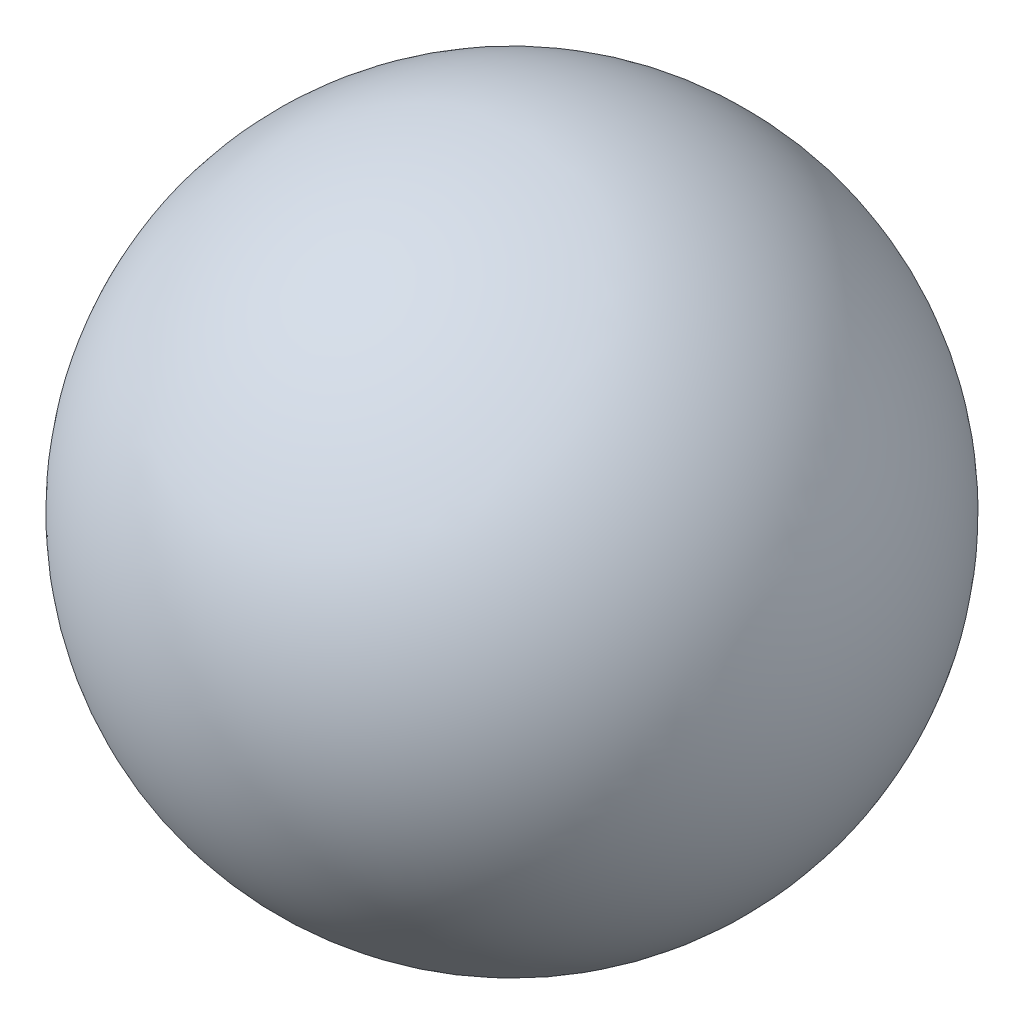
from build123d import *


with BuildPart() as part:
    # Esquisse1 → Base-R_volution (revolve)
    with BuildSketch(Plane.XY):
        with BuildLine():
            Line((-3.5, 0), (3.5, 0))
            ThreePointArc((3.5, 0), (0, 3.5), (-3.5, 0))
        make_face()
    revolve(axis=Axis((-4.415030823, 0, 0), (1, 0, 0)))


solid = part.part
